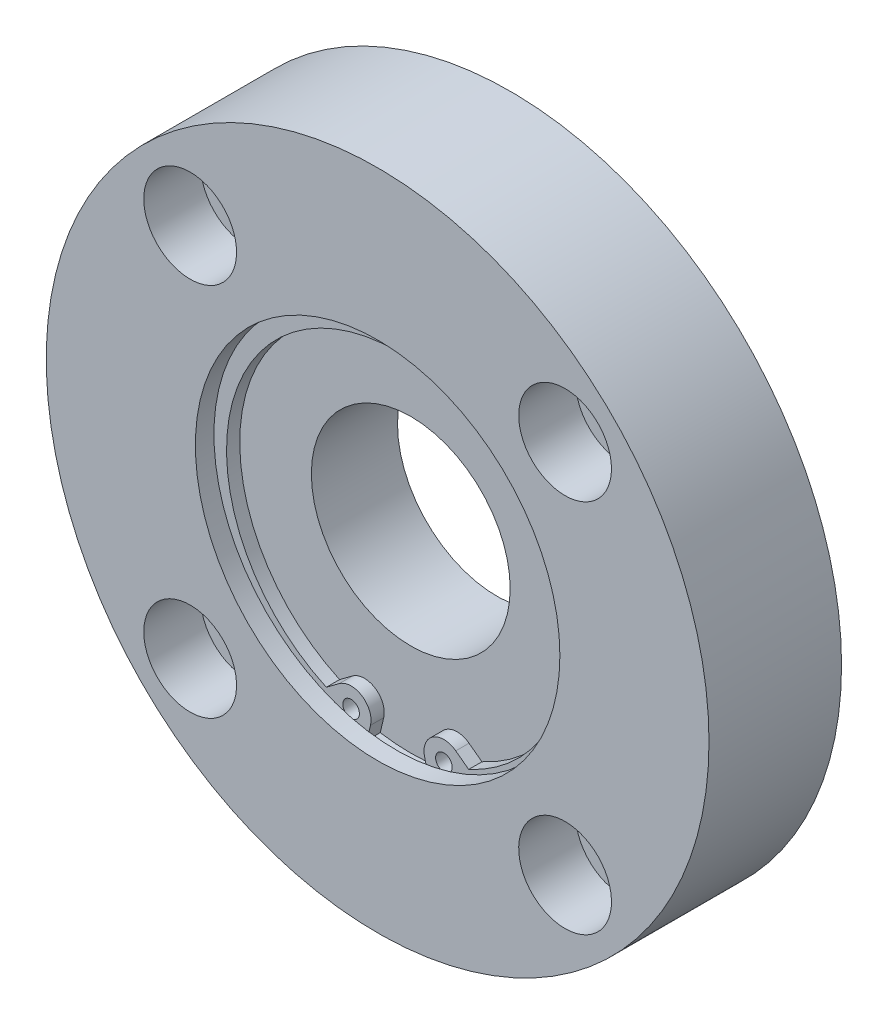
ISO-10303-21;
HEADER;
FILE_DESCRIPTION(('STEP AP214'),'2;1');
FILE_NAME('part.step','',(''),(''),'','','');
FILE_SCHEMA(('AUTOMOTIVE_DESIGN { 1 0 10303 214 1 1 1 1 }'));
ENDSEC;
DATA;
#1=APPLICATION_CONTEXT('core data for automotive mechanical design processes');
#2=APPLICATION_PROTOCOL_DEFINITION('international standard','automotive_design',2000,#1);
#3=PRODUCT_CONTEXT('',#1,'mechanical');
#4=PRODUCT('Part','Part','',(#3));
#5=PRODUCT_RELATED_PRODUCT_CATEGORY('part','',(#4));
#6=PRODUCT_DEFINITION_FORMATION('','',#4);
#7=PRODUCT_DEFINITION_CONTEXT('part definition',#1,'design');
#8=PRODUCT_DEFINITION('design','',#6,#7);
#9=PRODUCT_DEFINITION_SHAPE('','',#8);
#10=(LENGTH_UNIT() NAMED_UNIT(*) SI_UNIT(.MILLI.,.METRE.));
#11=(NAMED_UNIT(*) PLANE_ANGLE_UNIT() SI_UNIT($,.RADIAN.));
#12=(NAMED_UNIT(*) SI_UNIT($,.STERADIAN.) SOLID_ANGLE_UNIT());
#13=UNCERTAINTY_MEASURE_WITH_UNIT(LENGTH_MEASURE(1.E-05),#10,'distance_accuracy_value','');
#14=(GEOMETRIC_REPRESENTATION_CONTEXT(3) GLOBAL_UNCERTAINTY_ASSIGNED_CONTEXT((#13)) GLOBAL_UNIT_ASSIGNED_CONTEXT((#10,
#11,#12)) REPRESENTATION_CONTEXT('',''));
#15=CARTESIAN_POINT('',(0.,0.,0.));
#16=DIRECTION('',(0.,0.,1.));
#17=DIRECTION('',(1.,0.,0.));
#18=AXIS2_PLACEMENT_3D('',#15,#16,#17);
#19=CARTESIAN_POINT('',(28.2842712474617,28.2842712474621,0.));
#20=DIRECTION('',(0.,0.,1.));
#21=DIRECTION('',(1.,0.,0.));
#22=AXIS2_PLACEMENT_3D('',#19,#20,#21);
#23=CYLINDRICAL_SURFACE('',#22,5.);
#24=CARTESIAN_POINT('',(28.2842712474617,28.2842712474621,0.));
#25=DIRECTION('',(0.,0.,1.));
#26=DIRECTION('',(1.,0.,0.));
#27=AXIS2_PLACEMENT_3D('',#24,#25,#26);
#28=CIRCLE('',#27,5.);
#29=CARTESIAN_POINT('',(33.2842712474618,28.2842712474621,0.));
#30=VERTEX_POINT('',#29);
#31=EDGE_CURVE('E228',#30,#30,#28,.T.);
#32=ORIENTED_EDGE('',*,*,#31,.F.);
#33=EDGE_LOOP('',(#32));
#34=FACE_BOUND('',#33,.T.);
#35=CARTESIAN_POINT('',(28.2842712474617,28.2842712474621,11.4));
#36=DIRECTION('',(0.,0.,1.));
#37=DIRECTION('',(1.,0.,0.));
#38=AXIS2_PLACEMENT_3D('',#35,#36,#37);
#39=CIRCLE('',#38,5.);
#40=CARTESIAN_POINT('',(33.2842712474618,28.2842712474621,11.4));
#41=VERTEX_POINT('',#40);
#42=EDGE_CURVE('E225',#41,#41,#39,.F.);
#43=ORIENTED_EDGE('',*,*,#42,.F.);
#44=EDGE_LOOP('',(#43));
#45=FACE_BOUND('',#44,.T.);
#46=ADVANCED_FACE('F14',(#34,#45),#23,.F.);
#47=CARTESIAN_POINT('',(28.2842712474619,-28.2842712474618,0.));
#48=DIRECTION('',(0.,0.,1.));
#49=DIRECTION('',(1.,0.,0.));
#50=AXIS2_PLACEMENT_3D('',#47,#48,#49);
#51=CYLINDRICAL_SURFACE('',#50,5.);
#52=CARTESIAN_POINT('',(28.2842712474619,-28.2842712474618,0.));
#53=DIRECTION('',(0.,0.,1.));
#54=DIRECTION('',(0.,-1.,0.));
#55=AXIS2_PLACEMENT_3D('',#52,#53,#54);
#56=CIRCLE('',#55,5.);
#57=CARTESIAN_POINT('',(28.2842712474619,-33.2842712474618,0.));
#58=VERTEX_POINT('',#57);
#59=EDGE_CURVE('E242',#58,#58,#56,.T.);
#60=ORIENTED_EDGE('',*,*,#59,.F.);
#61=EDGE_LOOP('',(#60));
#62=FACE_BOUND('',#61,.T.);
#63=CARTESIAN_POINT('',(28.2842712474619,-28.2842712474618,11.4));
#64=DIRECTION('',(0.,0.,1.));
#65=DIRECTION('',(1.,0.,0.));
#66=AXIS2_PLACEMENT_3D('',#63,#64,#65);
#67=CIRCLE('',#66,5.);
#68=CARTESIAN_POINT('',(33.284271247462,-28.2842712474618,11.4));
#69=VERTEX_POINT('',#68);
#70=EDGE_CURVE('E220',#69,#69,#67,.F.);
#71=ORIENTED_EDGE('',*,*,#70,.F.);
#72=EDGE_LOOP('',(#71));
#73=FACE_BOUND('',#72,.T.);
#74=ADVANCED_FACE('F327',(#62,#73),#51,.F.);
#75=CARTESIAN_POINT('',(-28.2842712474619,-28.2842712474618,0.));
#76=DIRECTION('',(0.,0.,1.));
#77=DIRECTION('',(1.,0.,0.));
#78=AXIS2_PLACEMENT_3D('',#75,#76,#77);
#79=CYLINDRICAL_SURFACE('',#78,5.);
#80=CARTESIAN_POINT('',(-28.2842712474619,-28.2842712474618,0.));
#81=DIRECTION('',(0.,0.,1.));
#82=DIRECTION('',(-1.,0.,0.));
#83=AXIS2_PLACEMENT_3D('',#80,#81,#82);
#84=CIRCLE('',#83,5.);
#85=CARTESIAN_POINT('',(-33.284271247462,-28.2842712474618,0.));
#86=VERTEX_POINT('',#85);
#87=EDGE_CURVE('E245',#86,#86,#84,.T.);
#88=ORIENTED_EDGE('',*,*,#87,.F.);
#89=EDGE_LOOP('',(#88));
#90=FACE_BOUND('',#89,.T.);
#91=CARTESIAN_POINT('',(-28.2842712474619,-28.2842712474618,11.4));
#92=DIRECTION('',(0.,0.,1.));
#93=DIRECTION('',(1.,0.,0.));
#94=AXIS2_PLACEMENT_3D('',#91,#92,#93);
#95=CIRCLE('',#94,5.);
#96=CARTESIAN_POINT('',(-23.2842712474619,-28.2842712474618,11.4));
#97=VERTEX_POINT('',#96);
#98=EDGE_CURVE('E215',#97,#97,#95,.F.);
#99=ORIENTED_EDGE('',*,*,#98,.F.);
#100=EDGE_LOOP('',(#99));
#101=FACE_BOUND('',#100,.T.);
#102=ADVANCED_FACE('F333',(#90,#101),#79,.F.);
#103=CARTESIAN_POINT('',(-28.2842712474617,28.2842712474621,0.));
#104=DIRECTION('',(0.,0.,1.));
#105=DIRECTION('',(1.,0.,0.));
#106=AXIS2_PLACEMENT_3D('',#103,#104,#105);
#107=CYLINDRICAL_SURFACE('',#106,5.);
#108=CARTESIAN_POINT('',(-28.2842712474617,28.2842712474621,0.));
#109=DIRECTION('',(0.,0.,1.));
#110=DIRECTION('',(0.,1.,0.));
#111=AXIS2_PLACEMENT_3D('',#108,#109,#110);
#112=CIRCLE('',#111,5.);
#113=CARTESIAN_POINT('',(-28.2842712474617,33.2842712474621,0.));
#114=VERTEX_POINT('',#113);
#115=EDGE_CURVE('E223',#114,#114,#112,.T.);
#116=ORIENTED_EDGE('',*,*,#115,.F.);
#117=EDGE_LOOP('',(#116));
#118=FACE_BOUND('',#117,.T.);
#119=CARTESIAN_POINT('',(-28.2842712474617,28.2842712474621,11.4));
#120=DIRECTION('',(0.,0.,1.));
#121=DIRECTION('',(1.,0.,0.));
#122=AXIS2_PLACEMENT_3D('',#119,#120,#121);
#123=CIRCLE('',#122,5.);
#124=CARTESIAN_POINT('',(-23.2842712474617,28.2842712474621,11.4));
#125=VERTEX_POINT('',#124);
#126=EDGE_CURVE('E210',#125,#125,#123,.F.);
#127=ORIENTED_EDGE('',*,*,#126,.F.);
#128=EDGE_LOOP('',(#127));
#129=FACE_BOUND('',#128,.T.);
#130=ADVANCED_FACE('F385',(#118,#129),#107,.F.);
#131=CARTESIAN_POINT('',(28.2842712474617,28.2842712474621,11.4));
#132=DIRECTION('',(0.,0.,1.));
#133=DIRECTION('',(1.,0.,0.));
#134=AXIS2_PLACEMENT_3D('',#131,#132,#133);
#135=PLANE('',#134);
#136=CARTESIAN_POINT('',(28.2842712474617,28.2842712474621,11.4));
#137=DIRECTION('',(0.,0.,1.));
#138=DIRECTION('',(1.,0.,0.));
#139=AXIS2_PLACEMENT_3D('',#136,#137,#138);
#140=CIRCLE('',#139,7.);
#141=CARTESIAN_POINT('',(35.2842712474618,28.2842712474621,11.4));
#142=VERTEX_POINT('',#141);
#143=EDGE_CURVE('E229',#142,#142,#140,.T.);
#144=ORIENTED_EDGE('',*,*,#143,.T.);
#145=EDGE_LOOP('',(#144));
#146=FACE_BOUND('',#145,.T.);
#147=ORIENTED_EDGE('',*,*,#42,.T.);
#148=EDGE_LOOP('',(#147));
#149=FACE_BOUND('',#148,.T.);
#150=ADVANCED_FACE('F380',(#146,#149),#135,.T.);
#151=CARTESIAN_POINT('',(28.2842712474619,-28.2842712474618,11.4));
#152=DIRECTION('',(0.,0.,1.));
#153=DIRECTION('',(0.,-1.,0.));
#154=AXIS2_PLACEMENT_3D('',#151,#152,#153);
#155=PLANE('',#154);
#156=CARTESIAN_POINT('',(28.2842712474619,-28.2842712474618,11.4));
#157=DIRECTION('',(0.,0.,1.));
#158=DIRECTION('',(0.,-1.,0.));
#159=AXIS2_PLACEMENT_3D('',#156,#157,#158);
#160=CIRCLE('',#159,7.);
#161=CARTESIAN_POINT('',(28.2842712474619,-35.2842712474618,11.4));
#162=VERTEX_POINT('',#161);
#163=EDGE_CURVE('E224',#162,#162,#160,.T.);
#164=ORIENTED_EDGE('',*,*,#163,.T.);
#165=EDGE_LOOP('',(#164));
#166=FACE_BOUND('',#165,.T.);
#167=ORIENTED_EDGE('',*,*,#70,.T.);
#168=EDGE_LOOP('',(#167));
#169=FACE_BOUND('',#168,.T.);
#170=ADVANCED_FACE('F372',(#166,#169),#155,.T.);
#171=CARTESIAN_POINT('',(-28.2842712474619,-28.2842712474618,11.4));
#172=DIRECTION('',(0.,0.,1.));
#173=DIRECTION('',(-1.,0.,0.));
#174=AXIS2_PLACEMENT_3D('',#171,#172,#173);
#175=PLANE('',#174);
#176=CARTESIAN_POINT('',(-28.2842712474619,-28.2842712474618,11.4));
#177=DIRECTION('',(0.,0.,1.));
#178=DIRECTION('',(-1.,0.,0.));
#179=AXIS2_PLACEMENT_3D('',#176,#177,#178);
#180=CIRCLE('',#179,7.);
#181=CARTESIAN_POINT('',(-35.284271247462,-28.2842712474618,11.4));
#182=VERTEX_POINT('',#181);
#183=EDGE_CURVE('E219',#182,#182,#180,.T.);
#184=ORIENTED_EDGE('',*,*,#183,.T.);
#185=EDGE_LOOP('',(#184));
#186=FACE_BOUND('',#185,.T.);
#187=ORIENTED_EDGE('',*,*,#98,.T.);
#188=EDGE_LOOP('',(#187));
#189=FACE_BOUND('',#188,.T.);
#190=ADVANCED_FACE('F320',(#186,#189),#175,.T.);
#191=CARTESIAN_POINT('',(-28.2842712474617,28.2842712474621,11.4));
#192=DIRECTION('',(0.,0.,1.));
#193=DIRECTION('',(0.,1.,0.));
#194=AXIS2_PLACEMENT_3D('',#191,#192,#193);
#195=PLANE('',#194);
#196=CARTESIAN_POINT('',(-28.2842712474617,28.2842712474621,11.4));
#197=DIRECTION('',(0.,0.,1.));
#198=DIRECTION('',(0.,1.,0.));
#199=AXIS2_PLACEMENT_3D('',#196,#197,#198);
#200=CIRCLE('',#199,7.);
#201=CARTESIAN_POINT('',(-28.2842712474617,35.2842712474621,11.4));
#202=VERTEX_POINT('',#201);
#203=EDGE_CURVE('E214',#202,#202,#200,.T.);
#204=ORIENTED_EDGE('',*,*,#203,.T.);
#205=EDGE_LOOP('',(#204));
#206=FACE_BOUND('',#205,.T.);
#207=ORIENTED_EDGE('',*,*,#126,.T.);
#208=EDGE_LOOP('',(#207));
#209=FACE_BOUND('',#208,.T.);
#210=ADVANCED_FACE('F313',(#206,#209),#195,.T.);
#211=CARTESIAN_POINT('',(0.,0.,0.));
#212=DIRECTION('',(0.,0.,1.));
#213=DIRECTION('',(1.,0.,0.));
#214=AXIS2_PLACEMENT_3D('',#211,#212,#213);
#215=PLANE('',#214);
#216=CARTESIAN_POINT('',(0.,0.,0.));
#217=DIRECTION('',(0.,0.,-1.));
#218=DIRECTION('',(-1.,0.,0.));
#219=AXIS2_PLACEMENT_3D('',#216,#217,#218);
#220=CIRCLE('',#219,24.);
#221=CARTESIAN_POINT('',(-24.,0.,0.));
#222=VERTEX_POINT('',#221);
#223=EDGE_CURVE('E199',#222,#222,#220,.T.);
#224=ORIENTED_EDGE('',*,*,#223,.F.);
#225=EDGE_LOOP('',(#224));
#226=FACE_BOUND('',#225,.T.);
#227=ORIENTED_EDGE('',*,*,#115,.T.);
#228=EDGE_LOOP('',(#227));
#229=FACE_BOUND('',#228,.T.);
#230=ORIENTED_EDGE('',*,*,#87,.T.);
#231=EDGE_LOOP('',(#230));
#232=FACE_BOUND('',#231,.T.);
#233=ORIENTED_EDGE('',*,*,#59,.T.);
#234=EDGE_LOOP('',(#233));
#235=FACE_BOUND('',#234,.T.);
#236=ORIENTED_EDGE('',*,*,#31,.T.);
#237=EDGE_LOOP('',(#236));
#238=FACE_BOUND('',#237,.T.);
#239=CARTESIAN_POINT('',(0.,0.,0.));
#240=DIRECTION('',(0.,0.,1.));
#241=DIRECTION('',(1.,0.,0.));
#242=AXIS2_PLACEMENT_3D('',#239,#240,#241);
#243=CIRCLE('',#242,50.);
#244=CARTESIAN_POINT('',(50.,0.,0.));
#245=VERTEX_POINT('',#244);
#246=EDGE_CURVE('E232',#245,#245,#243,.T.);
#247=ORIENTED_EDGE('',*,*,#246,.F.);
#248=EDGE_LOOP('',(#247));
#249=FACE_BOUND('',#248,.T.);
#250=ADVANCED_FACE('F308',(#226,#229,#232,#235,#238,#249),#215,.F.);
#251=CARTESIAN_POINT('',(0.,0.,20.));
#252=DIRECTION('',(0.,0.,-1.));
#253=DIRECTION('',(-1.,0.,0.));
#254=AXIS2_PLACEMENT_3D('',#251,#252,#253);
#255=CYLINDRICAL_SURFACE('',#254,50.);
#256=CARTESIAN_POINT('',(0.,0.,20.));
#257=DIRECTION('',(0.,0.,1.));
#258=DIRECTION('',(1.,0.,0.));
#259=AXIS2_PLACEMENT_3D('',#256,#257,#258);
#260=CIRCLE('',#259,50.);
#261=CARTESIAN_POINT('',(50.,0.,20.));
#262=VERTEX_POINT('',#261);
#263=EDGE_CURVE('E195',#262,#262,#260,.T.);
#264=ORIENTED_EDGE('',*,*,#263,.F.);
#265=EDGE_LOOP('',(#264));
#266=FACE_BOUND('',#265,.T.);
#267=ORIENTED_EDGE('',*,*,#246,.T.);
#268=EDGE_LOOP('',(#267));
#269=FACE_BOUND('',#268,.T.);
#270=ADVANCED_FACE('F304',(#266,#269),#255,.T.);
#271=CARTESIAN_POINT('',(28.2842712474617,28.2842712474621,11.4));
#272=DIRECTION('',(0.,0.,1.));
#273=DIRECTION('',(1.,0.,0.));
#274=AXIS2_PLACEMENT_3D('',#271,#272,#273);
#275=CYLINDRICAL_SURFACE('',#274,7.);
#276=ORIENTED_EDGE('',*,*,#143,.F.);
#277=EDGE_LOOP('',(#276));
#278=FACE_BOUND('',#277,.T.);
#279=CARTESIAN_POINT('',(28.2842712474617,28.2842712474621,20.));
#280=DIRECTION('',(0.,0.,1.));
#281=DIRECTION('',(1.,0.,0.));
#282=AXIS2_PLACEMENT_3D('',#279,#280,#281);
#283=CIRCLE('',#282,7.);
#284=CARTESIAN_POINT('',(35.2842712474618,28.2842712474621,20.));
#285=VERTEX_POINT('',#284);
#286=EDGE_CURVE('E239',#285,#285,#283,.T.);
#287=ORIENTED_EDGE('',*,*,#286,.T.);
#288=EDGE_LOOP('',(#287));
#289=FACE_BOUND('',#288,.T.);
#290=ADVANCED_FACE('F307',(#278,#289),#275,.F.);
#291=CARTESIAN_POINT('',(28.2842712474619,-28.2842712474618,11.4));
#292=DIRECTION('',(0.,0.,1.));
#293=DIRECTION('',(1.,0.,0.));
#294=AXIS2_PLACEMENT_3D('',#291,#292,#293);
#295=CYLINDRICAL_SURFACE('',#294,7.);
#296=ORIENTED_EDGE('',*,*,#163,.F.);
#297=EDGE_LOOP('',(#296));
#298=FACE_BOUND('',#297,.T.);
#299=CARTESIAN_POINT('',(28.2842712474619,-28.2842712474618,20.));
#300=DIRECTION('',(0.,0.,1.));
#301=DIRECTION('',(0.,-1.,0.));
#302=AXIS2_PLACEMENT_3D('',#299,#300,#301);
#303=CIRCLE('',#302,7.);
#304=CARTESIAN_POINT('',(28.2842712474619,-35.2842712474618,20.));
#305=VERTEX_POINT('',#304);
#306=EDGE_CURVE('E218',#305,#305,#303,.T.);
#307=ORIENTED_EDGE('',*,*,#306,.T.);
#308=EDGE_LOOP('',(#307));
#309=FACE_BOUND('',#308,.T.);
#310=ADVANCED_FACE('F376',(#298,#309),#295,.F.);
#311=CARTESIAN_POINT('',(-28.2842712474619,-28.2842712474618,11.4));
#312=DIRECTION('',(0.,0.,1.));
#313=DIRECTION('',(1.,0.,0.));
#314=AXIS2_PLACEMENT_3D('',#311,#312,#313);
#315=CYLINDRICAL_SURFACE('',#314,7.);
#316=ORIENTED_EDGE('',*,*,#183,.F.);
#317=EDGE_LOOP('',(#316));
#318=FACE_BOUND('',#317,.T.);
#319=CARTESIAN_POINT('',(-28.2842712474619,-28.2842712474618,20.));
#320=DIRECTION('',(0.,0.,1.));
#321=DIRECTION('',(-1.,0.,0.));
#322=AXIS2_PLACEMENT_3D('',#319,#320,#321);
#323=CIRCLE('',#322,7.);
#324=CARTESIAN_POINT('',(-35.284271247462,-28.2842712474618,20.));
#325=VERTEX_POINT('',#324);
#326=EDGE_CURVE('E213',#325,#325,#323,.T.);
#327=ORIENTED_EDGE('',*,*,#326,.T.);
#328=EDGE_LOOP('',(#327));
#329=FACE_BOUND('',#328,.T.);
#330=ADVANCED_FACE('F365',(#318,#329),#315,.F.);
#331=CARTESIAN_POINT('',(-28.2842712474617,28.2842712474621,11.4));
#332=DIRECTION('',(0.,0.,1.));
#333=DIRECTION('',(1.,0.,0.));
#334=AXIS2_PLACEMENT_3D('',#331,#332,#333);
#335=CYLINDRICAL_SURFACE('',#334,7.);
#336=ORIENTED_EDGE('',*,*,#203,.F.);
#337=EDGE_LOOP('',(#336));
#338=FACE_BOUND('',#337,.T.);
#339=CARTESIAN_POINT('',(-28.2842712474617,28.2842712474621,20.));
#340=DIRECTION('',(0.,0.,1.));
#341=DIRECTION('',(0.,1.,0.));
#342=AXIS2_PLACEMENT_3D('',#339,#340,#341);
#343=CIRCLE('',#342,7.);
#344=CARTESIAN_POINT('',(-28.2842712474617,35.2842712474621,20.));
#345=VERTEX_POINT('',#344);
#346=EDGE_CURVE('E209',#345,#345,#343,.T.);
#347=ORIENTED_EDGE('',*,*,#346,.T.);
#348=EDGE_LOOP('',(#347));
#349=FACE_BOUND('',#348,.T.);
#350=ADVANCED_FACE('F360',(#338,#349),#335,.F.);
#351=CARTESIAN_POINT('',(0.,0.,2.));
#352=DIRECTION('',(0.,0.,-1.));
#353=DIRECTION('',(-1.,0.,0.));
#354=AXIS2_PLACEMENT_3D('',#351,#352,#353);
#355=CYLINDRICAL_SURFACE('',#354,24.);
#356=CARTESIAN_POINT('',(0.,0.,2.));
#357=DIRECTION('',(0.,0.,-1.));
#358=DIRECTION('',(-1.,0.,0.));
#359=AXIS2_PLACEMENT_3D('',#356,#357,#358);
#360=CIRCLE('',#359,24.);
#361=CARTESIAN_POINT('',(-24.,0.,2.));
#362=VERTEX_POINT('',#361);
#363=EDGE_CURVE('E205',#362,#362,#360,.T.);
#364=ORIENTED_EDGE('',*,*,#363,.F.);
#365=EDGE_LOOP('',(#364));
#366=FACE_BOUND('',#365,.T.);
#367=ORIENTED_EDGE('',*,*,#223,.T.);
#368=EDGE_LOOP('',(#367));
#369=FACE_BOUND('',#368,.T.);
#370=ADVANCED_FACE('F292',(#366,#369),#355,.F.);
#371=CARTESIAN_POINT('',(0.,0.,20.));
#372=DIRECTION('',(0.,0.,1.));
#373=DIRECTION('',(1.,0.,0.));
#374=AXIS2_PLACEMENT_3D('',#371,#372,#373);
#375=PLANE('',#374);
#376=CARTESIAN_POINT('',(0.,0.,20.));
#377=DIRECTION('',(0.,0.,1.));
#378=DIRECTION('',(1.,0.,0.));
#379=AXIS2_PLACEMENT_3D('',#376,#377,#378);
#380=CIRCLE('',#379,27.5);
#381=CARTESIAN_POINT('',(27.5,0.,20.));
#382=VERTEX_POINT('',#381);
#383=EDGE_CURVE('E204',#382,#382,#380,.T.);
#384=ORIENTED_EDGE('',*,*,#383,.F.);
#385=EDGE_LOOP('',(#384));
#386=FACE_BOUND('',#385,.T.);
#387=ORIENTED_EDGE('',*,*,#346,.F.);
#388=EDGE_LOOP('',(#387));
#389=FACE_BOUND('',#388,.T.);
#390=ORIENTED_EDGE('',*,*,#326,.F.);
#391=EDGE_LOOP('',(#390));
#392=FACE_BOUND('',#391,.T.);
#393=ORIENTED_EDGE('',*,*,#306,.F.);
#394=EDGE_LOOP('',(#393));
#395=FACE_BOUND('',#394,.T.);
#396=ORIENTED_EDGE('',*,*,#286,.F.);
#397=EDGE_LOOP('',(#396));
#398=FACE_BOUND('',#397,.T.);
#399=ORIENTED_EDGE('',*,*,#263,.T.);
#400=EDGE_LOOP('',(#399));
#401=FACE_BOUND('',#400,.T.);
#402=ADVANCED_FACE('F289',(#386,#389,#392,#395,#398,#401),#375,.T.);
#403=CARTESIAN_POINT('',(0.,0.,2.));
#404=DIRECTION('',(0.,0.,-1.));
#405=DIRECTION('',(-1.,0.,0.));
#406=AXIS2_PLACEMENT_3D('',#403,#404,#405);
#407=PLANE('',#406);
#408=CARTESIAN_POINT('',(0.,0.,2.));
#409=DIRECTION('',(0.,0.,-1.));
#410=DIRECTION('',(-1.,0.,0.));
#411=AXIS2_PLACEMENT_3D('',#408,#409,#410);
#412=CIRCLE('',#411,15.);
#413=CARTESIAN_POINT('',(-15.,0.,2.));
#414=VERTEX_POINT('',#413);
#415=EDGE_CURVE('E201',#414,#414,#412,.T.);
#416=ORIENTED_EDGE('',*,*,#415,.F.);
#417=EDGE_LOOP('',(#416));
#418=FACE_BOUND('',#417,.T.);
#419=ORIENTED_EDGE('',*,*,#363,.T.);
#420=EDGE_LOOP('',(#419));
#421=FACE_BOUND('',#420,.T.);
#422=ADVANCED_FACE('F285',(#418,#421),#407,.T.);
#423=CARTESIAN_POINT('',(0.,0.,15.));
#424=DIRECTION('',(0.,0.,1.));
#425=DIRECTION('',(1.,0.,0.));
#426=AXIS2_PLACEMENT_3D('',#423,#424,#425);
#427=CYLINDRICAL_SURFACE('',#426,27.5);
#428=CARTESIAN_POINT('',(0.,0.,17.2));
#429=DIRECTION('',(0.,0.,1.));
#430=DIRECTION('',(1.,0.,0.));
#431=AXIS2_PLACEMENT_3D('',#428,#429,#430);
#432=CIRCLE('',#431,27.5);
#433=CARTESIAN_POINT('',(27.5,0.,17.2));
#434=VERTEX_POINT('',#433);
#435=EDGE_CURVE('E196',#434,#434,#432,.F.);
#436=ORIENTED_EDGE('',*,*,#435,.T.);
#437=EDGE_LOOP('',(#436));
#438=FACE_BOUND('',#437,.T.);
#439=ORIENTED_EDGE('',*,*,#383,.T.);
#440=EDGE_LOOP('',(#439));
#441=FACE_BOUND('',#440,.T.);
#442=ADVANCED_FACE('F281',(#438,#441),#427,.F.);
#443=CARTESIAN_POINT('',(0.,0.,20.));
#444=DIRECTION('',(0.,0.,-1.));
#445=DIRECTION('',(-1.,0.,0.));
#446=AXIS2_PLACEMENT_3D('',#443,#444,#445);
#447=CYLINDRICAL_SURFACE('',#446,15.);
#448=CARTESIAN_POINT('',(0.,0.,15.));
#449=DIRECTION('',(0.,0.,1.));
#450=DIRECTION('',(1.,0.,0.));
#451=AXIS2_PLACEMENT_3D('',#448,#449,#450);
#452=CIRCLE('',#451,15.);
#453=CARTESIAN_POINT('',(15.,0.,15.));
#454=VERTEX_POINT('',#453);
#455=EDGE_CURVE('E206',#454,#454,#452,.T.);
#456=ORIENTED_EDGE('',*,*,#455,.T.);
#457=EDGE_LOOP('',(#456));
#458=FACE_BOUND('',#457,.T.);
#459=ORIENTED_EDGE('',*,*,#415,.T.);
#460=EDGE_LOOP('',(#459));
#461=FACE_BOUND('',#460,.T.);
#462=ADVANCED_FACE('F284',(#458,#461),#447,.F.);
#463=CARTESIAN_POINT('',(0.,0.,15.));
#464=DIRECTION('',(0.,0.,1.));
#465=DIRECTION('',(1.,0.,0.));
#466=AXIS2_PLACEMENT_3D('',#463,#464,#465);
#467=PLANE('',#466);
#468=ORIENTED_EDGE('',*,*,#455,.F.);
#469=EDGE_LOOP('',(#468));
#470=FACE_BOUND('',#469,.T.);
#471=CARTESIAN_POINT('',(0.,0.,15.));
#472=DIRECTION('',(0.,0.,1.));
#473=DIRECTION('',(1.,0.,0.));
#474=AXIS2_PLACEMENT_3D('',#471,#472,#473);
#475=CIRCLE('',#474,29.);
#476=CARTESIAN_POINT('',(-4.60946385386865,-28.6313262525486,15.));
#477=VERTEX_POINT('',#476);
#478=CARTESIAN_POINT('',(4.60946385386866,-28.6313262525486,15.));
#479=VERTEX_POINT('',#478);
#480=EDGE_CURVE('E158',#477,#479,#475,.T.);
#481=ORIENTED_EDGE('',*,*,#480,.T.);
#482=DIRECTION('',(-0.231349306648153,0.972870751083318,0.));
#483=VECTOR('',#482,1.);
#484=CARTESIAN_POINT('',(-2.08138392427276,-0.494954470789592,15.));
#485=LINE('',#484,#483);
#486=CARTESIAN_POINT('',(4.08138774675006,-26.4106591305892,15.));
#487=VERTEX_POINT('',#486);
#488=EDGE_CURVE('E9',#479,#487,#485,.T.);
#489=ORIENTED_EDGE('',*,*,#488,.T.);
#490=CARTESIAN_POINT('',(7.,-25.7166112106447,15.));
#491=DIRECTION('',(0.,0.,1.));
#492=DIRECTION('',(1.,0.,0.));
#493=AXIS2_PLACEMENT_3D('',#490,#491,#492);
#494=CIRCLE('',#493,3.);
#495=CARTESIAN_POINT('',(8.7896612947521,-23.3088918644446,15.));
#496=VERTEX_POINT('',#495);
#497=EDGE_CURVE('E25',#496,#487,#494,.T.);
#498=ORIENTED_EDGE('',*,*,#497,.F.);
#499=DIRECTION('',(0.802573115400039,-0.596553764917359,0.));
#500=VECTOR('',#499,1.);
#501=CARTESIAN_POINT('',(-8.0317519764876,-10.8055108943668,15.));
#502=LINE('',#501,#500);
#503=CARTESIAN_POINT('',(10.7397756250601,-24.7584146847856,15.));
#504=VERTEX_POINT('',#503);
#505=EDGE_CURVE('E104',#496,#504,#502,.T.);
#506=ORIENTED_EDGE('',*,*,#505,.T.);
#507=CARTESIAN_POINT('',(0.,-1.3,15.));
#508=DIRECTION('',(0.,0.,1.));
#509=DIRECTION('',(1.,0.,0.));
#510=AXIS2_PLACEMENT_3D('',#507,#508,#509);
#511=CIRCLE('',#510,25.8);
#512=CARTESIAN_POINT('',(-10.7397756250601,-24.7584146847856,15.));
#513=VERTEX_POINT('',#512);
#514=EDGE_CURVE('E108',#504,#513,#511,.T.);
#515=ORIENTED_EDGE('',*,*,#514,.T.);
#516=DIRECTION('',(0.802573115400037,0.596553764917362,0.));
#517=VECTOR('',#516,1.);
#518=CARTESIAN_POINT('',(8.03175197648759,-10.8055108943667,15.));
#519=LINE('',#518,#517);
#520=CARTESIAN_POINT('',(-8.7896612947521,-23.3088918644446,15.));
#521=VERTEX_POINT('',#520);
#522=EDGE_CURVE('E122',#513,#521,#519,.T.);
#523=ORIENTED_EDGE('',*,*,#522,.T.);
#524=CARTESIAN_POINT('',(-7.,-25.7166112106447,15.));
#525=DIRECTION('',(0.,0.,1.));
#526=DIRECTION('',(1.,0.,0.));
#527=AXIS2_PLACEMENT_3D('',#524,#525,#526);
#528=CIRCLE('',#527,3.);
#529=CARTESIAN_POINT('',(-4.08138774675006,-26.4106591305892,15.));
#530=VERTEX_POINT('',#529);
#531=EDGE_CURVE('E177',#530,#521,#528,.T.);
#532=ORIENTED_EDGE('',*,*,#531,.F.);
#533=DIRECTION('',(-0.231349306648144,-0.97287075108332,0.));
#534=VECTOR('',#533,1.);
#535=CARTESIAN_POINT('',(2.08138392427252,-0.494954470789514,15.));
#536=LINE('',#535,#534);
#537=EDGE_CURVE('E175',#530,#477,#536,.T.);
#538=ORIENTED_EDGE('',*,*,#537,.T.);
#539=EDGE_LOOP('',(#481,#489,#498,#506,#515,#523,#532,#538));
#540=FACE_BOUND('',#539,.T.);
#541=ADVANCED_FACE('F107',(#470,#540),#467,.T.);
#542=CARTESIAN_POINT('',(0.,0.,17.2));
#543=DIRECTION('',(0.,0.,1.));
#544=DIRECTION('',(1.,0.,0.));
#545=AXIS2_PLACEMENT_3D('',#542,#543,#544);
#546=PLANE('',#545);
#547=CARTESIAN_POINT('',(0.,0.,17.2));
#548=DIRECTION('',(0.,0.,1.));
#549=DIRECTION('',(1.,0.,0.));
#550=AXIS2_PLACEMENT_3D('',#547,#548,#549);
#551=CIRCLE('',#550,29.);
#552=CARTESIAN_POINT('',(29.,0.,17.2));
#553=VERTEX_POINT('',#552);
#554=EDGE_CURVE('E200',#553,#553,#551,.T.);
#555=ORIENTED_EDGE('',*,*,#554,.F.);
#556=EDGE_LOOP('',(#555));
#557=FACE_BOUND('',#556,.T.);
#558=ORIENTED_EDGE('',*,*,#435,.F.);
#559=EDGE_LOOP('',(#558));
#560=FACE_BOUND('',#559,.T.);
#561=ADVANCED_FACE('F275',(#557,#560),#546,.F.);
#562=CARTESIAN_POINT('',(0.,0.,17.2));
#563=DIRECTION('',(0.,0.,-1.));
#564=DIRECTION('',(-1.,0.,0.));
#565=AXIS2_PLACEMENT_3D('',#562,#563,#564);
#566=CYLINDRICAL_SURFACE('',#565,29.);
#567=ORIENTED_EDGE('',*,*,#554,.T.);
#568=EDGE_LOOP('',(#567));
#569=FACE_BOUND('',#568,.T.);
#570=CARTESIAN_POINT('',(0.,0.,17.));
#571=DIRECTION('',(0.,0.,-1.));
#572=DIRECTION('',(-1.,0.,0.));
#573=AXIS2_PLACEMENT_3D('',#570,#571,#572);
#574=CIRCLE('',#573,29.);
#575=CARTESIAN_POINT('',(-4.60946385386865,-28.6313262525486,17.));
#576=VERTEX_POINT('',#575);
#577=CARTESIAN_POINT('',(4.60946385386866,-28.6313262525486,17.));
#578=VERTEX_POINT('',#577);
#579=EDGE_CURVE('E191',#576,#578,#574,.T.);
#580=ORIENTED_EDGE('',*,*,#579,.T.);
#581=DIRECTION('',(0.,0.,-1.));
#582=VECTOR('',#581,1.);
#583=CARTESIAN_POINT('',(4.60946385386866,-28.6313262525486,17.2));
#584=LINE('',#583,#582);
#585=EDGE_CURVE('E189',#578,#479,#584,.T.);
#586=ORIENTED_EDGE('',*,*,#585,.T.);
#587=ORIENTED_EDGE('',*,*,#480,.F.);
#588=DIRECTION('',(0.,0.,-1.));
#589=VECTOR('',#588,1.);
#590=CARTESIAN_POINT('',(-4.60946385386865,-28.6313262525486,17.2));
#591=LINE('',#590,#589);
#592=EDGE_CURVE('E76',#477,#576,#591,.F.);
#593=ORIENTED_EDGE('',*,*,#592,.T.);
#594=EDGE_LOOP('',(#580,#586,#587,#593));
#595=FACE_BOUND('',#594,.T.);
#596=ADVANCED_FACE('F272',(#569,#595),#566,.F.);
#597=CARTESIAN_POINT('',(7.,-25.7166112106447,15.));
#598=DIRECTION('',(0.,0.,1.));
#599=DIRECTION('',(1.,0.,0.));
#600=AXIS2_PLACEMENT_3D('',#597,#598,#599);
#601=CIRCLE('',#600,1.25);
#602=CARTESIAN_POINT('',(8.25,-25.7166112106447,15.));
#603=VERTEX_POINT('',#602);
#604=EDGE_CURVE('E185',#603,#603,#601,.T.);
#605=ORIENTED_EDGE('',*,*,#604,.T.);
#606=EDGE_LOOP('',(#605));
#607=FACE_BOUND('',#606,.T.);
#608=ADVANCED_FACE('F348',(#607),#467,.T.);
#609=CARTESIAN_POINT('',(-7.,-25.7166112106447,15.));
#610=DIRECTION('',(0.,0.,1.));
#611=DIRECTION('',(1.,0.,0.));
#612=AXIS2_PLACEMENT_3D('',#609,#610,#611);
#613=CIRCLE('',#612,1.25);
#614=CARTESIAN_POINT('',(-5.75,-25.7166112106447,15.));
#615=VERTEX_POINT('',#614);
#616=EDGE_CURVE('E181',#615,#615,#613,.T.);
#617=ORIENTED_EDGE('',*,*,#616,.T.);
#618=EDGE_LOOP('',(#617));
#619=FACE_BOUND('',#618,.T.);
#620=ADVANCED_FACE('F347',(#619),#467,.T.);
#621=CARTESIAN_POINT('',(8.7896612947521,-23.3088918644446,17.));
#622=DIRECTION('',(-0.596553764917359,-0.802573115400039,0.));
#623=DIRECTION('',(-0.802573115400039,0.596553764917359,0.));
#624=AXIS2_PLACEMENT_3D('',#621,#622,#623);
#625=PLANE('',#624);
#626=ORIENTED_EDGE('',*,*,#505,.F.);
#627=DIRECTION('',(0.,0.,-1.));
#628=VECTOR('',#627,1.);
#629=CARTESIAN_POINT('',(8.7896612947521,-23.3088918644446,17.));
#630=LINE('',#629,#628);
#631=CARTESIAN_POINT('',(8.7896612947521,-23.3088918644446,17.));
#632=VERTEX_POINT('',#631);
#633=EDGE_CURVE('E142',#632,#496,#630,.T.);
#634=ORIENTED_EDGE('',*,*,#633,.F.);
#635=DIRECTION('',(-0.802573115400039,0.596553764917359,0.));
#636=VECTOR('',#635,1.);
#637=CARTESIAN_POINT('',(8.7896612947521,-23.3088918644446,17.));
#638=LINE('',#637,#636);
#639=CARTESIAN_POINT('',(10.7397756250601,-24.7584146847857,17.));
#640=VERTEX_POINT('',#639);
#641=EDGE_CURVE('E126',#640,#632,#638,.T.);
#642=ORIENTED_EDGE('',*,*,#641,.F.);
#643=DIRECTION('',(0.,0.,-1.));
#644=VECTOR('',#643,1.);
#645=CARTESIAN_POINT('',(10.7397756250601,-24.7584146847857,17.));
#646=LINE('',#645,#644);
#647=EDGE_CURVE('E118',#640,#504,#646,.T.);
#648=ORIENTED_EDGE('',*,*,#647,.T.);
#649=EDGE_LOOP('',(#626,#634,#642,#648));
#650=FACE_BOUND('',#649,.T.);
#651=ADVANCED_FACE('F124',(#650),#625,.F.);
#652=CARTESIAN_POINT('',(0.,-1.3,17.));
#653=DIRECTION('',(0.,0.,1.));
#654=DIRECTION('',(-1.,0.,0.));
#655=AXIS2_PLACEMENT_3D('',#652,#653,#654);
#656=CYLINDRICAL_SURFACE('',#655,25.8);
#657=ORIENTED_EDGE('',*,*,#514,.F.);
#658=ORIENTED_EDGE('',*,*,#647,.F.);
#659=CARTESIAN_POINT('',(0.,-1.3,17.));
#660=DIRECTION('',(0.,0.,-1.));
#661=DIRECTION('',(0.,-1.,0.));
#662=AXIS2_PLACEMENT_3D('',#659,#660,#661);
#663=CIRCLE('',#662,25.8);
#664=CARTESIAN_POINT('',(-10.7397756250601,-24.7584146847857,17.));
#665=VERTEX_POINT('',#664);
#666=EDGE_CURVE('E133',#665,#640,#663,.T.);
#667=ORIENTED_EDGE('',*,*,#666,.F.);
#668=DIRECTION('',(0.,0.,-1.));
#669=VECTOR('',#668,1.);
#670=CARTESIAN_POINT('',(-10.7397756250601,-24.7584146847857,17.));
#671=LINE('',#670,#669);
#672=EDGE_CURVE('E120',#665,#513,#671,.T.);
#673=ORIENTED_EDGE('',*,*,#672,.T.);
#674=EDGE_LOOP('',(#657,#658,#667,#673));
#675=FACE_BOUND('',#674,.T.);
#676=ADVANCED_FACE('F116',(#675),#656,.F.);
#677=CARTESIAN_POINT('',(-8.7896612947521,-23.3088918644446,17.));
#678=DIRECTION('',(0.596553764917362,-0.802573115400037,0.));
#679=DIRECTION('',(0.,0.,-1.));
#680=AXIS2_PLACEMENT_3D('',#677,#678,#679);
#681=PLANE('',#680);
#682=ORIENTED_EDGE('',*,*,#522,.F.);
#683=ORIENTED_EDGE('',*,*,#672,.F.);
#684=DIRECTION('',(-0.802573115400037,-0.596553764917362,0.));
#685=VECTOR('',#684,1.);
#686=CARTESIAN_POINT('',(-8.7896612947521,-23.3088918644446,17.));
#687=LINE('',#686,#685);
#688=CARTESIAN_POINT('',(-8.7896612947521,-23.3088918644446,17.));
#689=VERTEX_POINT('',#688);
#690=EDGE_CURVE('E67',#689,#665,#687,.T.);
#691=ORIENTED_EDGE('',*,*,#690,.F.);
#692=DIRECTION('',(0.,0.,-1.));
#693=VECTOR('',#692,1.);
#694=CARTESIAN_POINT('',(-8.7896612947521,-23.3088918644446,17.));
#695=LINE('',#694,#693);
#696=EDGE_CURVE('E131',#689,#521,#695,.T.);
#697=ORIENTED_EDGE('',*,*,#696,.T.);
#698=EDGE_LOOP('',(#682,#683,#691,#697));
#699=FACE_BOUND('',#698,.T.);
#700=ADVANCED_FACE('F511',(#699),#681,.F.);
#701=CARTESIAN_POINT('',(-7.,-25.7166112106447,17.));
#702=DIRECTION('',(0.,0.,1.));
#703=DIRECTION('',(-1.,0.,0.));
#704=AXIS2_PLACEMENT_3D('',#701,#702,#703);
#705=CYLINDRICAL_SURFACE('',#704,1.25);
#706=ORIENTED_EDGE('',*,*,#616,.F.);
#707=EDGE_LOOP('',(#706));
#708=FACE_BOUND('',#707,.T.);
#709=CARTESIAN_POINT('',(-7.,-25.7166112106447,17.));
#710=DIRECTION('',(0.,0.,-1.));
#711=DIRECTION('',(1.,0.,0.));
#712=AXIS2_PLACEMENT_3D('',#709,#710,#711);
#713=CIRCLE('',#712,1.25);
#714=CARTESIAN_POINT('',(-5.75,-25.7166112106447,17.));
#715=VERTEX_POINT('',#714);
#716=EDGE_CURVE('E145',#715,#715,#713,.T.);
#717=ORIENTED_EDGE('',*,*,#716,.F.);
#718=EDGE_LOOP('',(#717));
#719=FACE_BOUND('',#718,.T.);
#720=ADVANCED_FACE('F521',(#708,#719),#705,.F.);
#721=CARTESIAN_POINT('',(7.,-25.7166112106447,17.));
#722=DIRECTION('',(0.,0.,1.));
#723=DIRECTION('',(-1.,0.,0.));
#724=AXIS2_PLACEMENT_3D('',#721,#722,#723);
#725=CYLINDRICAL_SURFACE('',#724,1.25);
#726=ORIENTED_EDGE('',*,*,#604,.F.);
#727=EDGE_LOOP('',(#726));
#728=FACE_BOUND('',#727,.T.);
#729=CARTESIAN_POINT('',(7.,-25.7166112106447,17.));
#730=DIRECTION('',(0.,0.,1.));
#731=DIRECTION('',(1.,0.,0.));
#732=AXIS2_PLACEMENT_3D('',#729,#730,#731);
#733=CIRCLE('',#732,1.25);
#734=CARTESIAN_POINT('',(8.25,-25.7166112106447,17.));
#735=VERTEX_POINT('',#734);
#736=EDGE_CURVE('E160',#735,#735,#733,.T.);
#737=ORIENTED_EDGE('',*,*,#736,.T.);
#738=EDGE_LOOP('',(#737));
#739=FACE_BOUND('',#738,.T.);
#740=ADVANCED_FACE('F485',(#728,#739),#725,.F.);
#741=CARTESIAN_POINT('',(7.,-25.7166112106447,17.));
#742=DIRECTION('',(0.,0.,1.));
#743=DIRECTION('',(-1.,0.,0.));
#744=AXIS2_PLACEMENT_3D('',#741,#742,#743);
#745=CYLINDRICAL_SURFACE('',#744,3.);
#746=ORIENTED_EDGE('',*,*,#497,.T.);
#747=DIRECTION('',(0.,0.,-1.));
#748=VECTOR('',#747,1.);
#749=CARTESIAN_POINT('',(4.08138774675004,-26.4106591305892,17.));
#750=LINE('',#749,#748);
#751=CARTESIAN_POINT('',(4.08138774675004,-26.4106591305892,17.));
#752=VERTEX_POINT('',#751);
#753=EDGE_CURVE('E146',#752,#487,#750,.T.);
#754=ORIENTED_EDGE('',*,*,#753,.F.);
#755=CARTESIAN_POINT('',(7.,-25.7166112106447,17.));
#756=DIRECTION('',(0.,0.,1.));
#757=DIRECTION('',(1.,0.,0.));
#758=AXIS2_PLACEMENT_3D('',#755,#756,#757);
#759=CIRCLE('',#758,3.);
#760=EDGE_CURVE('E136',#632,#752,#759,.T.);
#761=ORIENTED_EDGE('',*,*,#760,.F.);
#762=ORIENTED_EDGE('',*,*,#633,.T.);
#763=EDGE_LOOP('',(#746,#754,#761,#762));
#764=FACE_BOUND('',#763,.T.);
#765=ADVANCED_FACE('F502',(#764),#745,.T.);
#766=CARTESIAN_POINT('',(0.,-1.3,17.));
#767=DIRECTION('',(0.,0.,-1.));
#768=DIRECTION('',(0.,-1.,0.));
#769=AXIS2_PLACEMENT_3D('',#766,#767,#768);
#770=PLANE('',#769);
#771=ORIENTED_EDGE('',*,*,#736,.F.);
#772=EDGE_LOOP('',(#771));
#773=FACE_BOUND('',#772,.T.);
#774=ORIENTED_EDGE('',*,*,#716,.T.);
#775=EDGE_LOOP('',(#774));
#776=FACE_BOUND('',#775,.T.);
#777=ORIENTED_EDGE('',*,*,#579,.F.);
#778=DIRECTION('',(0.231349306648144,0.97287075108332,0.));
#779=VECTOR('',#778,1.);
#780=CARTESIAN_POINT('',(-4.08138774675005,-26.4106591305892,17.));
#781=LINE('',#780,#779);
#782=CARTESIAN_POINT('',(-4.08138774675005,-26.4106591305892,17.));
#783=VERTEX_POINT('',#782);
#784=EDGE_CURVE('E153',#576,#783,#781,.T.);
#785=ORIENTED_EDGE('',*,*,#784,.T.);
#786=CARTESIAN_POINT('',(-7.,-25.7166112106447,17.));
#787=DIRECTION('',(0.,0.,1.));
#788=DIRECTION('',(-1.,0.,0.));
#789=AXIS2_PLACEMENT_3D('',#786,#787,#788);
#790=CIRCLE('',#789,3.);
#791=EDGE_CURVE('E152',#783,#689,#790,.T.);
#792=ORIENTED_EDGE('',*,*,#791,.T.);
#793=ORIENTED_EDGE('',*,*,#690,.T.);
#794=ORIENTED_EDGE('',*,*,#666,.T.);
#795=ORIENTED_EDGE('',*,*,#641,.T.);
#796=ORIENTED_EDGE('',*,*,#760,.T.);
#797=DIRECTION('',(0.231349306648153,-0.972870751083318,0.));
#798=VECTOR('',#797,1.);
#799=CARTESIAN_POINT('',(4.08138774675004,-26.4106591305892,17.));
#800=LINE('',#799,#798);
#801=EDGE_CURVE('E18',#752,#578,#800,.T.);
#802=ORIENTED_EDGE('',*,*,#801,.T.);
#803=EDGE_LOOP('',(#777,#785,#792,#793,#794,#795,#796,#802));
#804=FACE_BOUND('',#803,.T.);
#805=ADVANCED_FACE('F476',(#773,#776,#804),#770,.F.);
#806=CARTESIAN_POINT('',(-7.,-25.7166112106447,17.));
#807=DIRECTION('',(0.,0.,1.));
#808=DIRECTION('',(-1.,0.,0.));
#809=AXIS2_PLACEMENT_3D('',#806,#807,#808);
#810=CYLINDRICAL_SURFACE('',#809,3.);
#811=ORIENTED_EDGE('',*,*,#531,.T.);
#812=ORIENTED_EDGE('',*,*,#696,.F.);
#813=ORIENTED_EDGE('',*,*,#791,.F.);
#814=DIRECTION('',(0.,0.,-1.));
#815=VECTOR('',#814,1.);
#816=CARTESIAN_POINT('',(-4.08138774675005,-26.4106591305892,17.));
#817=LINE('',#816,#815);
#818=EDGE_CURVE('E163',#783,#530,#817,.T.);
#819=ORIENTED_EDGE('',*,*,#818,.T.);
#820=EDGE_LOOP('',(#811,#812,#813,#819));
#821=FACE_BOUND('',#820,.T.);
#822=ADVANCED_FACE('F534',(#821),#810,.T.);
#823=CARTESIAN_POINT('',(-4.08138774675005,-26.4106591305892,17.));
#824=DIRECTION('',(-0.97287075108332,0.231349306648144,0.));
#825=DIRECTION('',(0.,0.,1.));
#826=AXIS2_PLACEMENT_3D('',#823,#824,#825);
#827=PLANE('',#826);
#828=ORIENTED_EDGE('',*,*,#592,.F.);
#829=ORIENTED_EDGE('',*,*,#537,.F.);
#830=ORIENTED_EDGE('',*,*,#818,.F.);
#831=ORIENTED_EDGE('',*,*,#784,.F.);
#832=EDGE_LOOP('',(#828,#829,#830,#831));
#833=FACE_BOUND('',#832,.T.);
#834=ADVANCED_FACE('F16',(#833),#827,.F.);
#835=CARTESIAN_POINT('',(4.08138774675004,-26.4106591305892,17.));
#836=DIRECTION('',(0.972870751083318,0.231349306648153,0.));
#837=DIRECTION('',(0.,0.,-1.));
#838=AXIS2_PLACEMENT_3D('',#835,#836,#837);
#839=PLANE('',#838);
#840=ORIENTED_EDGE('',*,*,#585,.F.);
#841=ORIENTED_EDGE('',*,*,#801,.F.);
#842=ORIENTED_EDGE('',*,*,#753,.T.);
#843=ORIENTED_EDGE('',*,*,#488,.F.);
#844=EDGE_LOOP('',(#840,#841,#842,#843));
#845=FACE_BOUND('',#844,.T.);
#846=ADVANCED_FACE('F554',(#845),#839,.F.);
#847=CLOSED_SHELL('',(#46,#74,#102,#130,#150,#170,#190,#210,#250,#270,#290,#310,#330,#350,#370,
#402,#422,#442,#462,#541,#561,#596,#608,#620,#651,#676,#700,#720,#740,#765,#805,#822,#834,#846));
#848=MANIFOLD_SOLID_BREP('B1',#847);
#849=ADVANCED_BREP_SHAPE_REPRESENTATION('',(#18,#848),#14);
#850=SHAPE_DEFINITION_REPRESENTATION(#9,#849);
ENDSEC;
END-ISO-10303-21;
